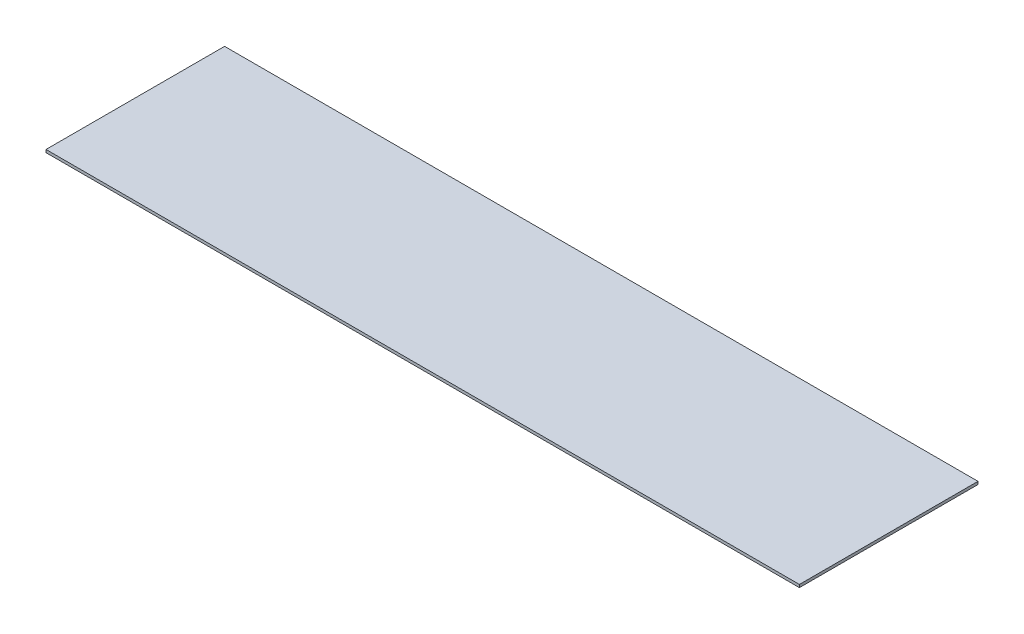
ISO-10303-21;
HEADER;
FILE_DESCRIPTION(('STEP AP214'),'2;1');
FILE_NAME('part.step','',(''),(''),'','','');
FILE_SCHEMA(('AUTOMOTIVE_DESIGN { 1 0 10303 214 1 1 1 1 }'));
ENDSEC;
DATA;
#1=APPLICATION_CONTEXT('core data for automotive mechanical design processes');
#2=APPLICATION_PROTOCOL_DEFINITION('international standard','automotive_design',2000,#1);
#3=PRODUCT_CONTEXT('',#1,'mechanical');
#4=PRODUCT('Part','Part','',(#3));
#5=PRODUCT_RELATED_PRODUCT_CATEGORY('part','',(#4));
#6=PRODUCT_DEFINITION_FORMATION('','',#4);
#7=PRODUCT_DEFINITION_CONTEXT('part definition',#1,'design');
#8=PRODUCT_DEFINITION('design','',#6,#7);
#9=PRODUCT_DEFINITION_SHAPE('','',#8);
#10=(LENGTH_UNIT() NAMED_UNIT(*) SI_UNIT(.MILLI.,.METRE.));
#11=(NAMED_UNIT(*) PLANE_ANGLE_UNIT() SI_UNIT($,.RADIAN.));
#12=(NAMED_UNIT(*) SI_UNIT($,.STERADIAN.) SOLID_ANGLE_UNIT());
#13=UNCERTAINTY_MEASURE_WITH_UNIT(LENGTH_MEASURE(1.E-05),#10,'distance_accuracy_value','');
#14=(GEOMETRIC_REPRESENTATION_CONTEXT(3) GLOBAL_UNCERTAINTY_ASSIGNED_CONTEXT((#13)) GLOBAL_UNIT_ASSIGNED_CONTEXT((#10,
#11,#12)) REPRESENTATION_CONTEXT('',''));
#15=CARTESIAN_POINT('',(0.,0.,0.));
#16=DIRECTION('',(0.,0.,1.));
#17=DIRECTION('',(1.,0.,0.));
#18=AXIS2_PLACEMENT_3D('',#15,#16,#17);
#19=CARTESIAN_POINT('',(0.,0.,-64.));
#20=DIRECTION('',(-1.,0.,0.));
#21=DIRECTION('',(0.,0.,1.));
#22=AXIS2_PLACEMENT_3D('',#19,#20,#21);
#23=PLANE('',#22);
#24=DIRECTION('',(0.,-1.,0.));
#25=VECTOR('',#24,1.);
#26=CARTESIAN_POINT('',(0.,0.,0.));
#27=LINE('',#26,#25);
#28=CARTESIAN_POINT('',(0.,1.,0.));
#29=VERTEX_POINT('',#28);
#30=CARTESIAN_POINT('',(0.,0.,0.));
#31=VERTEX_POINT('',#30);
#32=EDGE_CURVE('E66',#29,#31,#27,.T.);
#33=ORIENTED_EDGE('',*,*,#32,.F.);
#34=DIRECTION('',(0.,0.,1.));
#35=VECTOR('',#34,1.);
#36=CARTESIAN_POINT('',(0.,1.,-64.));
#37=LINE('',#36,#35);
#38=CARTESIAN_POINT('',(0.,1.,-64.));
#39=VERTEX_POINT('',#38);
#40=EDGE_CURVE('E11',#39,#29,#37,.T.);
#41=ORIENTED_EDGE('',*,*,#40,.F.);
#42=DIRECTION('',(0.,-1.,0.));
#43=VECTOR('',#42,1.);
#44=CARTESIAN_POINT('',(0.,0.,-64.));
#45=LINE('',#44,#43);
#46=CARTESIAN_POINT('',(0.,0.,-64.));
#47=VERTEX_POINT('',#46);
#48=EDGE_CURVE('E68',#39,#47,#45,.T.);
#49=ORIENTED_EDGE('',*,*,#48,.T.);
#50=DIRECTION('',(0.,0.,1.));
#51=VECTOR('',#50,1.);
#52=CARTESIAN_POINT('',(0.,0.,-64.));
#53=LINE('',#52,#51);
#54=EDGE_CURVE('E29',#47,#31,#53,.T.);
#55=ORIENTED_EDGE('',*,*,#54,.T.);
#56=EDGE_LOOP('',(#33,#41,#49,#55));
#57=FACE_BOUND('',#56,.T.);
#58=ADVANCED_FACE('F26',(#57),#23,.T.);
#59=CARTESIAN_POINT('',(0.,1.,-64.));
#60=DIRECTION('',(0.,1.,0.));
#61=DIRECTION('',(0.,0.,1.));
#62=AXIS2_PLACEMENT_3D('',#59,#60,#61);
#63=PLANE('',#62);
#64=DIRECTION('',(-1.,0.,0.));
#65=VECTOR('',#64,1.);
#66=CARTESIAN_POINT('',(0.,1.,0.));
#67=LINE('',#66,#65);
#68=CARTESIAN_POINT('',(270.,1.,0.));
#69=VERTEX_POINT('',#68);
#70=EDGE_CURVE('E83',#69,#29,#67,.T.);
#71=ORIENTED_EDGE('',*,*,#70,.F.);
#72=DIRECTION('',(0.,0.,1.));
#73=VECTOR('',#72,1.);
#74=CARTESIAN_POINT('',(270.,1.,-64.));
#75=LINE('',#74,#73);
#76=CARTESIAN_POINT('',(270.,1.,-64.));
#77=VERTEX_POINT('',#76);
#78=EDGE_CURVE('E34',#77,#69,#75,.T.);
#79=ORIENTED_EDGE('',*,*,#78,.F.);
#80=DIRECTION('',(-1.,0.,0.));
#81=VECTOR('',#80,1.);
#82=CARTESIAN_POINT('',(0.,1.,-64.));
#83=LINE('',#82,#81);
#84=EDGE_CURVE('E73',#77,#39,#83,.T.);
#85=ORIENTED_EDGE('',*,*,#84,.T.);
#86=ORIENTED_EDGE('',*,*,#40,.T.);
#87=EDGE_LOOP('',(#71,#79,#85,#86));
#88=FACE_BOUND('',#87,.T.);
#89=ADVANCED_FACE('F98',(#88),#63,.T.);
#90=CARTESIAN_POINT('',(270.,0.,-64.));
#91=DIRECTION('',(1.,0.,0.));
#92=DIRECTION('',(0.,0.,-1.));
#93=AXIS2_PLACEMENT_3D('',#90,#91,#92);
#94=PLANE('',#93);
#95=DIRECTION('',(0.,1.,0.));
#96=VECTOR('',#95,1.);
#97=CARTESIAN_POINT('',(270.,0.,0.));
#98=LINE('',#97,#96);
#99=CARTESIAN_POINT('',(270.,0.,0.));
#100=VERTEX_POINT('',#99);
#101=EDGE_CURVE('E80',#100,#69,#98,.T.);
#102=ORIENTED_EDGE('',*,*,#101,.F.);
#103=DIRECTION('',(0.,0.,1.));
#104=VECTOR('',#103,1.);
#105=CARTESIAN_POINT('',(270.,0.,-64.));
#106=LINE('',#105,#104);
#107=CARTESIAN_POINT('',(270.,0.,-64.));
#108=VERTEX_POINT('',#107);
#109=EDGE_CURVE('E72',#108,#100,#106,.T.);
#110=ORIENTED_EDGE('',*,*,#109,.F.);
#111=DIRECTION('',(0.,1.,0.));
#112=VECTOR('',#111,1.);
#113=CARTESIAN_POINT('',(270.,0.,-64.));
#114=LINE('',#113,#112);
#115=EDGE_CURVE('E91',#108,#77,#114,.T.);
#116=ORIENTED_EDGE('',*,*,#115,.T.);
#117=ORIENTED_EDGE('',*,*,#78,.T.);
#118=EDGE_LOOP('',(#102,#110,#116,#117));
#119=FACE_BOUND('',#118,.T.);
#120=ADVANCED_FACE('F95',(#119),#94,.T.);
#121=CARTESIAN_POINT('',(0.,0.,-64.));
#122=DIRECTION('',(0.,-1.,0.));
#123=DIRECTION('',(0.,0.,-1.));
#124=AXIS2_PLACEMENT_3D('',#121,#122,#123);
#125=PLANE('',#124);
#126=DIRECTION('',(1.,0.,0.));
#127=VECTOR('',#126,1.);
#128=CARTESIAN_POINT('',(0.,0.,0.));
#129=LINE('',#128,#127);
#130=EDGE_CURVE('E75',#31,#100,#129,.T.);
#131=ORIENTED_EDGE('',*,*,#130,.F.);
#132=ORIENTED_EDGE('',*,*,#54,.F.);
#133=DIRECTION('',(1.,0.,0.));
#134=VECTOR('',#133,1.);
#135=CARTESIAN_POINT('',(0.,0.,-64.));
#136=LINE('',#135,#134);
#137=EDGE_CURVE('E89',#47,#108,#136,.T.);
#138=ORIENTED_EDGE('',*,*,#137,.T.);
#139=ORIENTED_EDGE('',*,*,#109,.T.);
#140=EDGE_LOOP('',(#131,#132,#138,#139));
#141=FACE_BOUND('',#140,.T.);
#142=ADVANCED_FACE('F76',(#141),#125,.T.);
#143=CARTESIAN_POINT('',(0.,1.,-64.));
#144=DIRECTION('',(0.,0.,-1.));
#145=DIRECTION('',(-1.,0.,0.));
#146=AXIS2_PLACEMENT_3D('',#143,#144,#145);
#147=PLANE('',#146);
#148=ORIENTED_EDGE('',*,*,#48,.F.);
#149=ORIENTED_EDGE('',*,*,#84,.F.);
#150=ORIENTED_EDGE('',*,*,#115,.F.);
#151=ORIENTED_EDGE('',*,*,#137,.F.);
#152=EDGE_LOOP('',(#148,#149,#150,#151));
#153=FACE_BOUND('',#152,.T.);
#154=ADVANCED_FACE('F100',(#153),#147,.T.);
#155=CARTESIAN_POINT('',(0.,1.,0.));
#156=DIRECTION('',(0.,0.,-1.));
#157=DIRECTION('',(-1.,0.,0.));
#158=AXIS2_PLACEMENT_3D('',#155,#156,#157);
#159=PLANE('',#158);
#160=ORIENTED_EDGE('',*,*,#32,.T.);
#161=ORIENTED_EDGE('',*,*,#130,.T.);
#162=ORIENTED_EDGE('',*,*,#101,.T.);
#163=ORIENTED_EDGE('',*,*,#70,.T.);
#164=EDGE_LOOP('',(#160,#161,#162,#163));
#165=FACE_BOUND('',#164,.T.);
#166=ADVANCED_FACE('F82',(#165),#159,.F.);
#167=CLOSED_SHELL('',(#58,#89,#120,#142,#154,#166));
#168=MANIFOLD_SOLID_BREP('B2',#167);
#169=ADVANCED_BREP_SHAPE_REPRESENTATION('',(#18,#168),#14);
#170=SHAPE_DEFINITION_REPRESENTATION(#9,#169);
ENDSEC;
END-ISO-10303-21;
